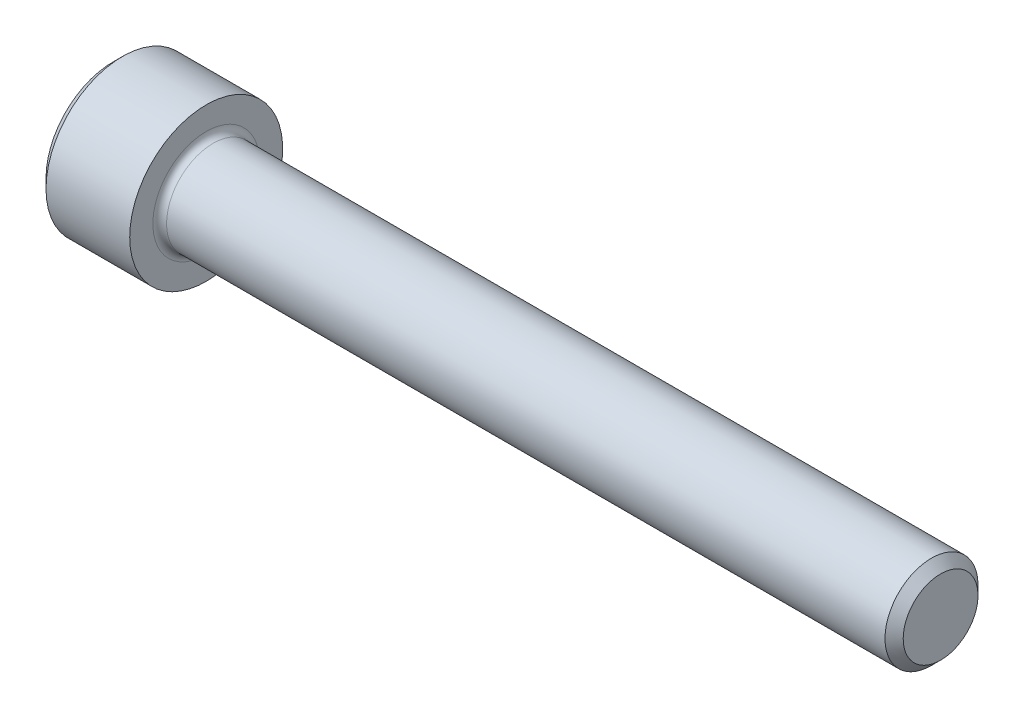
from build123d import *

# Parameters (mm, degrees)
FILLET1_R   = 0.3556
HEX_2_DEPTH = 2.286


with BuildPart() as part:
    # BodySke → Base-Revolve (revolve)
    with BuildSketch(Plane.XY, mode=Mode.PRIVATE) as base_revolve_sk:
        Polygon((0, 0), (0, 3.48615), (0.4826, 3.96875), (4.826, 3.96875), (4.826, 2.413), (42.45356, 2.413), (42.926, 1.94056), (42.926, 0), align=None)
    revolve(base_revolve_sk.sketch.rotate(Axis((-31.75, 0, 0), (1, 0, 0)), 90), axis=Axis((-31.75, 0, 0), (1, 0, 0)))

    # Fillet1
    fillet1_edges = [part.edges().sort_by_distance(p)[0] for p in [
        (4.826, 0, -2.413),
    ]]
    fillet(fillet1_edges, radius=FILLET1_R)

    # Sketch2 → Hex-PreBroach (revolve, cut)
    with BuildSketch(Plane.XY, mode=Mode.PRIVATE) as hex_prebroach_sk:
        Polygon((0, 1.98501), (2.286, 1.98501), (3.432046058, 0), (0, 0), align=None)
    revolve(hex_prebroach_sk.sketch.rotate(Axis((0, 0, 0), (1, 0, 0)), 90), axis=Axis((0, 0, 0), (1, 0, 0)), mode=Mode.SUBTRACT)

    # Sketch3 → Hex 2 (cut)
    with BuildSketch(Plane(origin=(0, 0, 0), x_dir=(0, 0.500000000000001, 0.866025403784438), z_dir=(-1, 0, 0))):
        Polygon((1.146046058, 1.98501), (-1.146046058, 1.98501), (-2.292092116, 0), (-1.146046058, -1.98501), (1.146046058, -1.98501), (2.292092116, 0), align=None)
    extrude(amount=-HEX_2_DEPTH, mode=Mode.SUBTRACT)


solid = part.part
